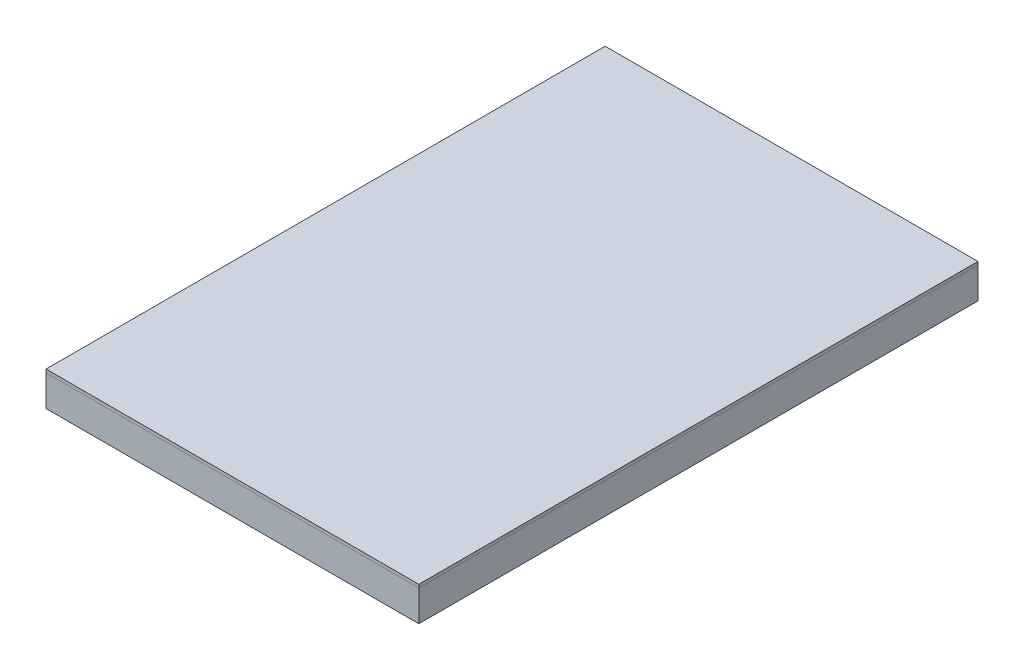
from build123d import *

# Parameters (mm, degrees)
SKETCH1_W           = 304.8
SKETCH1_H           = 457.2
EXTRUDE1_DEPTH      = 2.54
SKETCH1_2_W         = 304.8
SKETCH1_2_H         = 457.2
SKETCH1_2_W_2       = 254
SKETCH1_2_H_2       = 406.4
EXTRUDE_THIN1_DEPTH = 25.4


with BuildPart() as part:
    # Sketch1 → Extrude1 (new body)
    with BuildSketch(Plane(origin=(0, 0, 0), x_dir=(1, 0, 0), z_dir=(0, 1, 0))):
        Rectangle(SKETCH1_W, SKETCH1_H)
    extrude(amount=EXTRUDE1_DEPTH)


with BuildPart() as body_2:
    # Sketch1_2 → Extrude-Thin1 (new body)
    with BuildSketch(Plane(origin=(0, 0, 0), x_dir=(1, 0, 0), z_dir=(0, 1, 0))):
        Rectangle(SKETCH1_2_W, SKETCH1_2_H)
        Rectangle(SKETCH1_2_W_2, SKETCH1_2_H_2, mode=Mode.SUBTRACT)
    extrude(amount=-EXTRUDE_THIN1_DEPTH)


solid = Compound([part.part, body_2.part])
